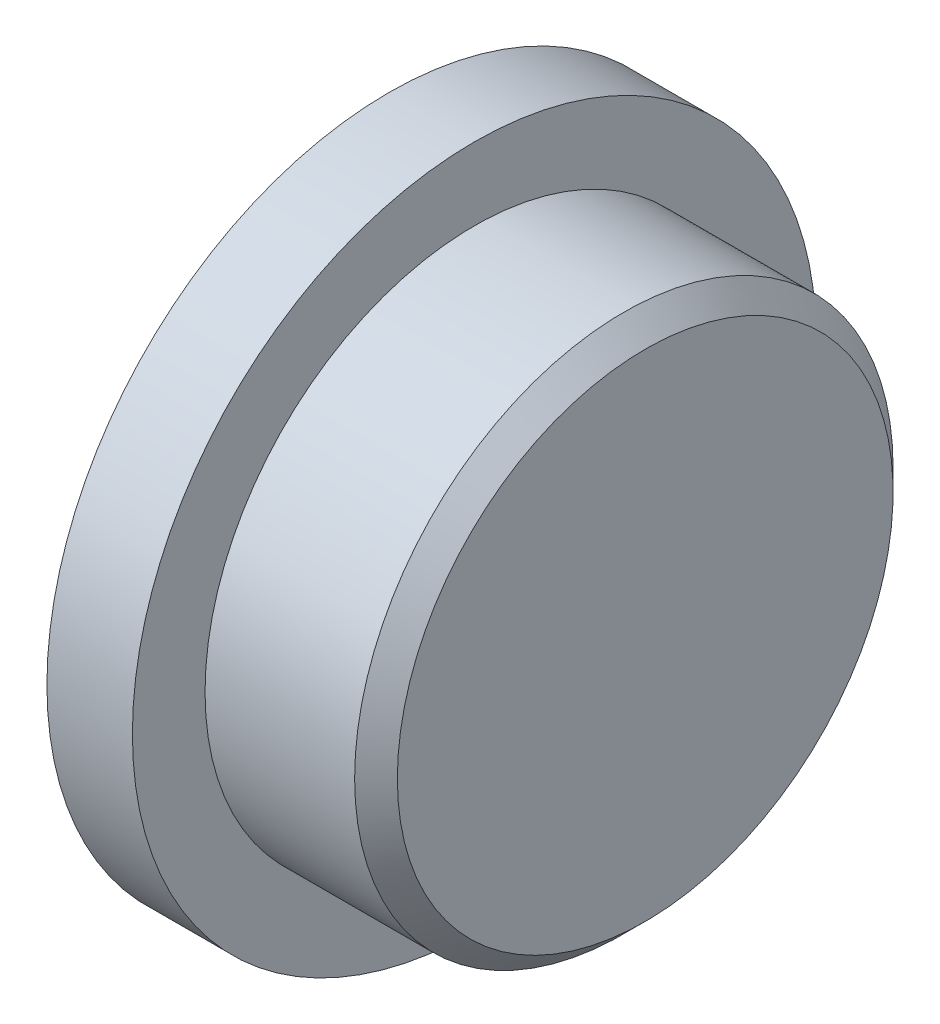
from build123d import *

# Parameters (mm, degrees)
CHAMFER1_SIZE = 0.25


with BuildPart() as part:
    # Sketch2 → Revolve1 (revolve)
    with BuildSketch(Plane.XY, mode=Mode.PRIVATE) as revolve1_sk:
        Polygon((0, 0), (3, 0), (3, 3.15), (1, 3.15), (1, 4), (0, 4), align=None)
    revolve(revolve1_sk.sketch.rotate(Axis((0, 0, 0), (1, 0, 0)), 90), axis=Axis((0, 0, 0), (1, 0, 0)))

    # Chamfer1
    chamfer1_edges = [part.edges().sort_by_distance(p)[0] for p in [
        (3, 0, -3.15),
    ]]
    chamfer(chamfer1_edges, length=CHAMFER1_SIZE)


solid = part.part
